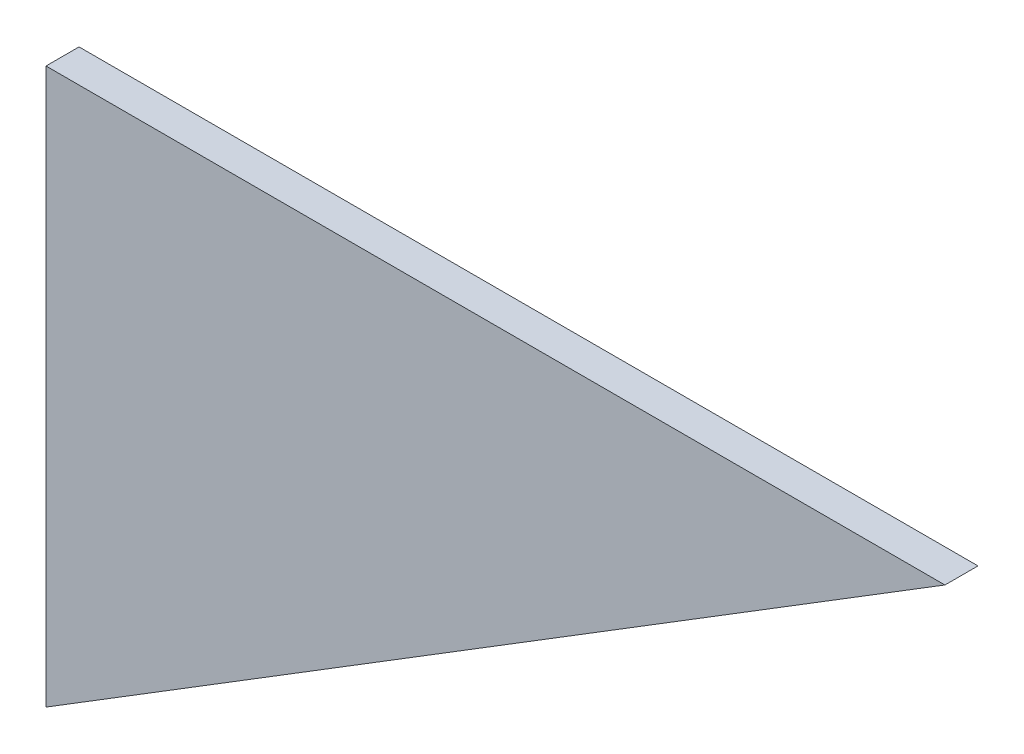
from build123d import *

# Parameters (mm, degrees)
EXTRUSION1_DEPTH = 5


with BuildPart() as part:
    # Esquisse1 → Extrusion1 (new body)
    with BuildSketch(Plane.XY):
        Polygon((-42.517391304, 28.395543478), (-42.517391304, -55.604456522), (93.482608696, 28.395543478), align=None)
    extrude(amount=EXTRUSION1_DEPTH)


solid = part.part
